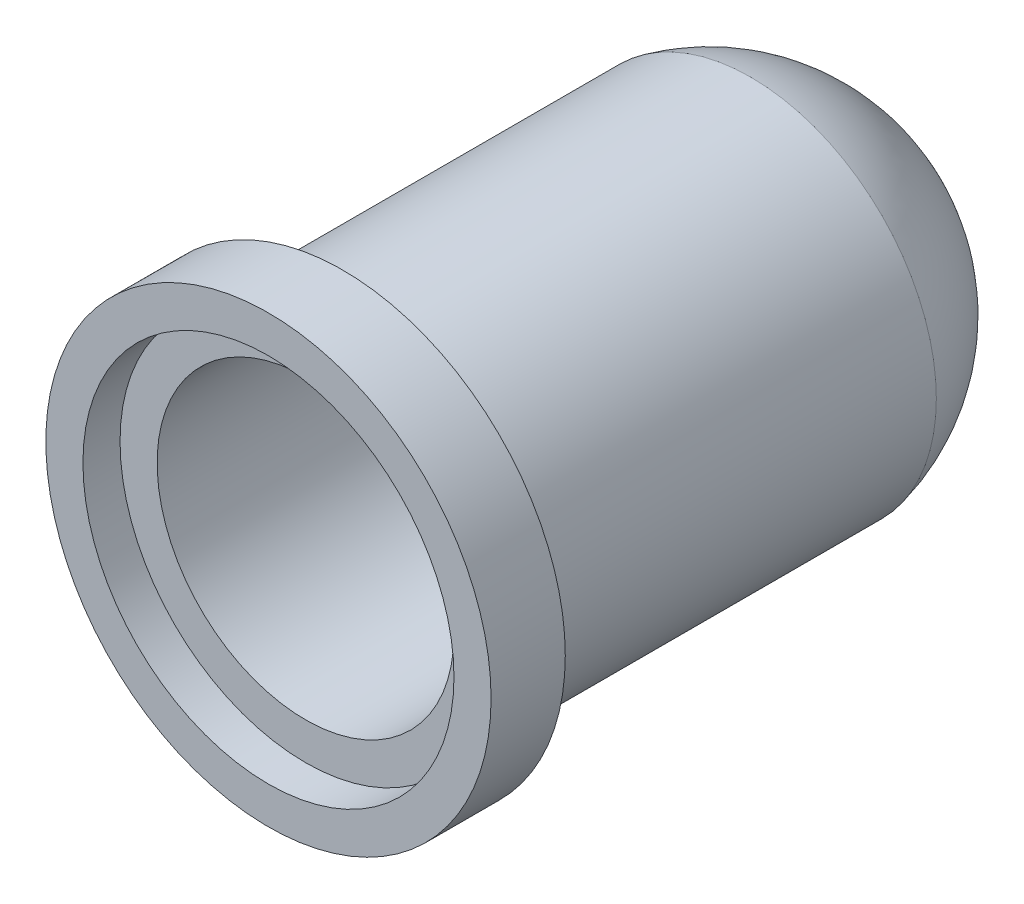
ISO-10303-21;
HEADER;
FILE_DESCRIPTION(('STEP AP214'),'2;1');
FILE_NAME('part.step','',(''),(''),'','','');
FILE_SCHEMA(('AUTOMOTIVE_DESIGN { 1 0 10303 214 1 1 1 1 }'));
ENDSEC;
DATA;
#1=APPLICATION_CONTEXT('core data for automotive mechanical design processes');
#2=APPLICATION_PROTOCOL_DEFINITION('international standard','automotive_design',2000,#1);
#3=PRODUCT_CONTEXT('',#1,'mechanical');
#4=PRODUCT('Part','Part','',(#3));
#5=PRODUCT_RELATED_PRODUCT_CATEGORY('part','',(#4));
#6=PRODUCT_DEFINITION_FORMATION('','',#4);
#7=PRODUCT_DEFINITION_CONTEXT('part definition',#1,'design');
#8=PRODUCT_DEFINITION('design','',#6,#7);
#9=PRODUCT_DEFINITION_SHAPE('','',#8);
#10=(LENGTH_UNIT() NAMED_UNIT(*) SI_UNIT(.MILLI.,.METRE.));
#11=(NAMED_UNIT(*) PLANE_ANGLE_UNIT() SI_UNIT($,.RADIAN.));
#12=(NAMED_UNIT(*) SI_UNIT($,.STERADIAN.) SOLID_ANGLE_UNIT());
#13=UNCERTAINTY_MEASURE_WITH_UNIT(LENGTH_MEASURE(1.E-05),#10,'distance_accuracy_value','');
#14=(GEOMETRIC_REPRESENTATION_CONTEXT(3) GLOBAL_UNCERTAINTY_ASSIGNED_CONTEXT((#13)) GLOBAL_UNIT_ASSIGNED_CONTEXT((#10,
#11,#12)) REPRESENTATION_CONTEXT('',''));
#15=CARTESIAN_POINT('',(0.,0.,0.));
#16=DIRECTION('',(0.,0.,1.));
#17=DIRECTION('',(1.,0.,0.));
#18=AXIS2_PLACEMENT_3D('',#15,#16,#17);
#19=CARTESIAN_POINT('',(0.,0.,-1.));
#20=DIRECTION('',(0.,0.,1.));
#21=DIRECTION('',(1.,0.,0.));
#22=AXIS2_PLACEMENT_3D('',#19,#20,#21);
#23=PLANE('',#22);
#24=CARTESIAN_POINT('',(0.,0.,-1.));
#25=DIRECTION('',(0.,0.,1.));
#26=DIRECTION('',(1.,0.,0.));
#27=AXIS2_PLACEMENT_3D('',#24,#25,#26);
#28=CIRCLE('',#27,3.);
#29=CARTESIAN_POINT('',(3.,0.,-1.));
#30=VERTEX_POINT('',#29);
#31=EDGE_CURVE('E36',#30,#30,#28,.T.);
#32=ORIENTED_EDGE('',*,*,#31,.F.);
#33=EDGE_LOOP('',(#32));
#34=FACE_BOUND('',#33,.T.);
#35=CARTESIAN_POINT('',(0.,0.,-1.));
#36=DIRECTION('',(0.,0.,1.));
#37=DIRECTION('',(1.,0.,0.));
#38=AXIS2_PLACEMENT_3D('',#35,#36,#37);
#39=CIRCLE('',#38,2.5);
#40=CARTESIAN_POINT('',(2.5,0.,-1.));
#41=VERTEX_POINT('',#40);
#42=EDGE_CURVE('E10',#41,#41,#39,.F.);
#43=ORIENTED_EDGE('',*,*,#42,.F.);
#44=EDGE_LOOP('',(#43));
#45=FACE_BOUND('',#44,.T.);
#46=ADVANCED_FACE('F28',(#34,#45),#23,.F.);
#47=CARTESIAN_POINT('',(0.,0.,-1.));
#48=DIRECTION('',(0.,0.,1.));
#49=DIRECTION('',(1.,0.,0.));
#50=AXIS2_PLACEMENT_3D('',#47,#48,#49);
#51=CYLINDRICAL_SURFACE('',#50,3.);
#52=ORIENTED_EDGE('',*,*,#31,.T.);
#53=EDGE_LOOP('',(#52));
#54=FACE_BOUND('',#53,.T.);
#55=CARTESIAN_POINT('',(0.,0.,0.));
#56=DIRECTION('',(0.,0.,1.));
#57=DIRECTION('',(1.,0.,0.));
#58=AXIS2_PLACEMENT_3D('',#55,#56,#57);
#59=CIRCLE('',#58,3.);
#60=CARTESIAN_POINT('',(3.,0.,0.));
#61=VERTEX_POINT('',#60);
#62=EDGE_CURVE('E40',#61,#61,#59,.T.);
#63=ORIENTED_EDGE('',*,*,#62,.F.);
#64=EDGE_LOOP('',(#63));
#65=FACE_BOUND('',#64,.T.);
#66=ADVANCED_FACE('F72',(#54,#65),#51,.T.);
#67=CARTESIAN_POINT('',(0.,0.,0.));
#68=DIRECTION('',(0.,0.,1.));
#69=DIRECTION('',(1.,0.,0.));
#70=AXIS2_PLACEMENT_3D('',#67,#68,#69);
#71=PLANE('',#70);
#72=CARTESIAN_POINT('',(0.,0.,0.));
#73=DIRECTION('',(0.,0.,1.));
#74=DIRECTION('',(1.,0.,0.));
#75=AXIS2_PLACEMENT_3D('',#72,#73,#74);
#76=CIRCLE('',#75,2.5);
#77=CARTESIAN_POINT('',(2.5,0.,0.));
#78=VERTEX_POINT('',#77);
#79=EDGE_CURVE('E45',#78,#78,#76,.T.);
#80=ORIENTED_EDGE('',*,*,#79,.F.);
#81=EDGE_LOOP('',(#80));
#82=FACE_BOUND('',#81,.T.);
#83=ORIENTED_EDGE('',*,*,#62,.T.);
#84=EDGE_LOOP('',(#83));
#85=FACE_BOUND('',#84,.T.);
#86=ADVANCED_FACE('F68',(#82,#85),#71,.T.);
#87=CARTESIAN_POINT('',(0.,0.,-6.5));
#88=DIRECTION('',(0.,0.,1.));
#89=DIRECTION('',(1.,0.,0.));
#90=AXIS2_PLACEMENT_3D('',#87,#88,#89);
#91=CYLINDRICAL_SURFACE('',#90,2.5);
#92=CARTESIAN_POINT('',(0.,0.,-6.5));
#93=DIRECTION('',(0.,0.,-1.));
#94=DIRECTION('',(-1.,0.,0.));
#95=AXIS2_PLACEMENT_3D('',#92,#93,#94);
#96=CIRCLE('',#95,2.5);
#97=CARTESIAN_POINT('',(-2.5,0.,-6.5));
#98=VERTEX_POINT('',#97);
#99=EDGE_CURVE('E32',#98,#98,#96,.T.);
#100=ORIENTED_EDGE('',*,*,#99,.F.);
#101=EDGE_LOOP('',(#100));
#102=FACE_BOUND('',#101,.T.);
#103=ORIENTED_EDGE('',*,*,#42,.T.);
#104=EDGE_LOOP('',(#103));
#105=FACE_BOUND('',#104,.T.);
#106=ADVANCED_FACE('F71',(#102,#105),#91,.T.);
#107=CARTESIAN_POINT('',(0.,0.,-5.9375));
#108=DIRECTION('',(0.,0.,1.));
#109=DIRECTION('',(1.,0.,0.));
#110=AXIS2_PLACEMENT_3D('',#107,#108,#109);
#111=SPHERICAL_SURFACE('',#110,2.5625);
#112=ORIENTED_EDGE('',*,*,#99,.T.);
#113=EDGE_LOOP('',(#112));
#114=FACE_BOUND('',#113,.T.);
#115=ADVANCED_FACE('F30',(#114),#111,.T.);
#116=CARTESIAN_POINT('',(0.,0.,-0.5));
#117=DIRECTION('',(0.,0.,1.));
#118=DIRECTION('',(1.,0.,0.));
#119=AXIS2_PLACEMENT_3D('',#116,#117,#118);
#120=PLANE('',#119);
#121=CARTESIAN_POINT('',(0.,0.,-0.5));
#122=DIRECTION('',(0.,0.,1.));
#123=DIRECTION('',(1.,0.,0.));
#124=AXIS2_PLACEMENT_3D('',#121,#122,#123);
#125=CIRCLE('',#124,2.5);
#126=CARTESIAN_POINT('',(2.5,0.,-0.5));
#127=VERTEX_POINT('',#126);
#128=EDGE_CURVE('E48',#127,#127,#125,.T.);
#129=ORIENTED_EDGE('',*,*,#128,.T.);
#130=EDGE_LOOP('',(#129));
#131=FACE_BOUND('',#130,.T.);
#132=CARTESIAN_POINT('',(0.,0.,-0.5));
#133=DIRECTION('',(0.,0.,1.));
#134=DIRECTION('',(1.,0.,0.));
#135=AXIS2_PLACEMENT_3D('',#132,#133,#134);
#136=CIRCLE('',#135,2.);
#137=CARTESIAN_POINT('',(2.,0.,-0.5));
#138=VERTEX_POINT('',#137);
#139=EDGE_CURVE('E52',#138,#138,#136,.F.);
#140=ORIENTED_EDGE('',*,*,#139,.T.);
#141=EDGE_LOOP('',(#140));
#142=FACE_BOUND('',#141,.T.);
#143=ADVANCED_FACE('F58',(#131,#142),#120,.T.);
#144=CARTESIAN_POINT('',(0.,0.,-1.));
#145=DIRECTION('',(0.,0.,1.));
#146=DIRECTION('',(1.,0.,0.));
#147=AXIS2_PLACEMENT_3D('',#144,#145,#146);
#148=CYLINDRICAL_SURFACE('',#147,2.5);
#149=ORIENTED_EDGE('',*,*,#128,.F.);
#150=EDGE_LOOP('',(#149));
#151=FACE_BOUND('',#150,.T.);
#152=ORIENTED_EDGE('',*,*,#79,.T.);
#153=EDGE_LOOP('',(#152));
#154=FACE_BOUND('',#153,.T.);
#155=ADVANCED_FACE('F61',(#151,#154),#148,.F.);
#156=CARTESIAN_POINT('',(0.,0.,-6.5));
#157=DIRECTION('',(0.,0.,1.));
#158=DIRECTION('',(1.,0.,0.));
#159=AXIS2_PLACEMENT_3D('',#156,#157,#158);
#160=CYLINDRICAL_SURFACE('',#159,2.);
#161=CARTESIAN_POINT('',(0.,0.,-6.44139110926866));
#162=DIRECTION('',(0.,0.,1.));
#163=DIRECTION('',(1.,0.,0.));
#164=AXIS2_PLACEMENT_3D('',#161,#162,#163);
#165=CIRCLE('',#164,2.);
#166=CARTESIAN_POINT('',(2.,0.,-6.44139110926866));
#167=VERTEX_POINT('',#166);
#168=EDGE_CURVE('E49',#167,#167,#165,.F.);
#169=ORIENTED_EDGE('',*,*,#168,.T.);
#170=EDGE_LOOP('',(#169));
#171=FACE_BOUND('',#170,.T.);
#172=ORIENTED_EDGE('',*,*,#139,.F.);
#173=EDGE_LOOP('',(#172));
#174=FACE_BOUND('',#173,.T.);
#175=ADVANCED_FACE('F64',(#171,#174),#160,.F.);
#176=CARTESIAN_POINT('',(0.,0.,-5.9375));
#177=DIRECTION('',(0.,0.,1.));
#178=DIRECTION('',(1.,0.,0.));
#179=AXIS2_PLACEMENT_3D('',#176,#177,#178);
#180=SPHERICAL_SURFACE('',#179,2.0625);
#181=ORIENTED_EDGE('',*,*,#168,.F.);
#182=EDGE_LOOP('',(#181));
#183=FACE_BOUND('',#182,.T.);
#184=ADVANCED_FACE('F87',(#183),#180,.F.);
#185=CLOSED_SHELL('',(#46,#66,#86,#106,#115,#143,#155,#175,#184));
#186=MANIFOLD_SOLID_BREP('B2',#185);
#187=ADVANCED_BREP_SHAPE_REPRESENTATION('',(#18,#186),#14);
#188=SHAPE_DEFINITION_REPRESENTATION(#9,#187);
ENDSEC;
END-ISO-10303-21;
